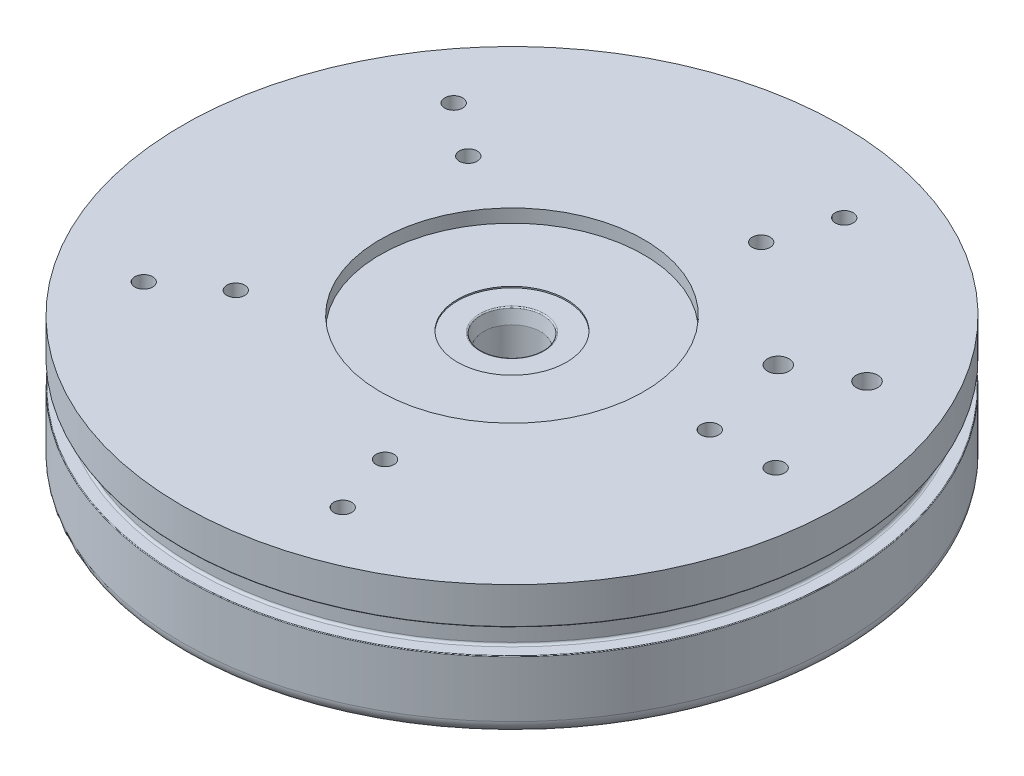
ISO-10303-21;
HEADER;
FILE_DESCRIPTION(('STEP AP214'),'2;1');
FILE_NAME('part.step','',(''),(''),'','','');
FILE_SCHEMA(('AUTOMOTIVE_DESIGN { 1 0 10303 214 1 1 1 1 }'));
ENDSEC;
DATA;
#1=APPLICATION_CONTEXT('core data for automotive mechanical design processes');
#2=APPLICATION_PROTOCOL_DEFINITION('international standard','automotive_design',2000,#1);
#3=PRODUCT_CONTEXT('',#1,'mechanical');
#4=PRODUCT('Part','Part','',(#3));
#5=PRODUCT_RELATED_PRODUCT_CATEGORY('part','',(#4));
#6=PRODUCT_DEFINITION_FORMATION('','',#4);
#7=PRODUCT_DEFINITION_CONTEXT('part definition',#1,'design');
#8=PRODUCT_DEFINITION('design','',#6,#7);
#9=PRODUCT_DEFINITION_SHAPE('','',#8);
#10=(LENGTH_UNIT() NAMED_UNIT(*) SI_UNIT(.MILLI.,.METRE.));
#11=(NAMED_UNIT(*) PLANE_ANGLE_UNIT() SI_UNIT($,.RADIAN.));
#12=(NAMED_UNIT(*) SI_UNIT($,.STERADIAN.) SOLID_ANGLE_UNIT());
#13=UNCERTAINTY_MEASURE_WITH_UNIT(LENGTH_MEASURE(1.E-05),#10,'distance_accuracy_value','');
#14=(GEOMETRIC_REPRESENTATION_CONTEXT(3) GLOBAL_UNCERTAINTY_ASSIGNED_CONTEXT((#13)) GLOBAL_UNIT_ASSIGNED_CONTEXT((#10,
#11,#12)) REPRESENTATION_CONTEXT('',''));
#15=CARTESIAN_POINT('',(0.,0.,0.));
#16=DIRECTION('',(0.,0.,1.));
#17=DIRECTION('',(1.,0.,0.));
#18=AXIS2_PLACEMENT_3D('',#15,#16,#17);
#19=CARTESIAN_POINT('',(0.,-12.065,0.));
#20=DIRECTION('',(0.,-1.,0.));
#21=DIRECTION('',(0.,0.,-1.));
#22=AXIS2_PLACEMENT_3D('',#19,#20,#21);
#23=TOROIDAL_SURFACE('',#22,63.373,0.127);
#24=CARTESIAN_POINT('',(0.,-12.065,0.));
#25=DIRECTION('',(0.,-1.,0.));
#26=DIRECTION('',(0.,0.,-1.));
#27=AXIS2_PLACEMENT_3D('',#24,#25,#26);
#28=CIRCLE('',#27,63.5);
#29=CARTESIAN_POINT('',(0.,-12.065,-63.5));
#30=VERTEX_POINT('',#29);
#31=EDGE_CURVE('E233',#30,#30,#28,.T.);
#32=ORIENTED_EDGE('',*,*,#31,.F.);
#33=EDGE_LOOP('',(#32));
#34=FACE_BOUND('',#33,.T.);
#35=CARTESIAN_POINT('',(0.,-11.938,0.));
#36=DIRECTION('',(0.,-1.,0.));
#37=DIRECTION('',(0.,0.,-1.));
#38=AXIS2_PLACEMENT_3D('',#35,#36,#37);
#39=CIRCLE('',#38,63.373);
#40=CARTESIAN_POINT('',(0.,-11.938,-63.373));
#41=VERTEX_POINT('',#40);
#42=EDGE_CURVE('E203',#41,#41,#39,.T.);
#43=ORIENTED_EDGE('',*,*,#42,.T.);
#44=EDGE_LOOP('',(#43));
#45=FACE_BOUND('',#44,.T.);
#46=ADVANCED_FACE('F47',(#34,#45),#23,.T.);
#47=CARTESIAN_POINT('',(0.,-12.7,0.));
#48=DIRECTION('',(0.,-1.,0.));
#49=DIRECTION('',(0.,0.,-1.));
#50=AXIS2_PLACEMENT_3D('',#47,#48,#49);
#51=CYLINDRICAL_SURFACE('',#50,63.5);
#52=CARTESIAN_POINT('',(0.,-22.86,0.));
#53=DIRECTION('',(0.,1.,0.));
#54=DIRECTION('',(0.,0.,1.));
#55=AXIS2_PLACEMENT_3D('',#52,#53,#54);
#56=CIRCLE('',#55,63.5);
#57=CARTESIAN_POINT('',(0.,-22.86,63.5));
#58=VERTEX_POINT('',#57);
#59=EDGE_CURVE('E13',#58,#58,#56,.T.);
#60=ORIENTED_EDGE('',*,*,#59,.T.);
#61=EDGE_LOOP('',(#60));
#62=FACE_BOUND('',#61,.T.);
#63=ORIENTED_EDGE('',*,*,#31,.T.);
#64=EDGE_LOOP('',(#63));
#65=FACE_BOUND('',#64,.T.);
#66=ADVANCED_FACE('F258',(#62,#65),#51,.T.);
#67=CARTESIAN_POINT('',(-63.5,-25.4,0.));
#68=DIRECTION('',(0.,1.,0.));
#69=DIRECTION('',(0.,0.,1.));
#70=AXIS2_PLACEMENT_3D('',#67,#68,#69);
#71=PLANE('',#70);
#72=CARTESIAN_POINT('',(0.,-25.4,0.));
#73=DIRECTION('',(0.,1.,0.));
#74=DIRECTION('',(0.,0.,1.));
#75=AXIS2_PLACEMENT_3D('',#72,#73,#74);
#76=CIRCLE('',#75,60.96);
#77=CARTESIAN_POINT('',(0.,-25.4,60.96));
#78=VERTEX_POINT('',#77);
#79=EDGE_CURVE('E56',#78,#78,#76,.F.);
#80=ORIENTED_EDGE('',*,*,#79,.T.);
#81=EDGE_LOOP('',(#80));
#82=FACE_BOUND('',#81,.T.);
#83=CARTESIAN_POINT('',(0.,-25.4,0.));
#84=DIRECTION('',(0.,-1.,0.));
#85=DIRECTION('',(0.,0.,-1.));
#86=AXIS2_PLACEMENT_3D('',#83,#84,#85);
#87=CIRCLE('',#86,50.8);
#88=CARTESIAN_POINT('',(0.,-25.4,-50.8));
#89=VERTEX_POINT('',#88);
#90=EDGE_CURVE('E230',#89,#89,#87,.T.);
#91=ORIENTED_EDGE('',*,*,#90,.F.);
#92=EDGE_LOOP('',(#91));
#93=FACE_BOUND('',#92,.T.);
#94=ADVANCED_FACE('F239',(#82,#93),#71,.F.);
#95=CARTESIAN_POINT('',(0.,-25.4,0.));
#96=DIRECTION('',(0.,-1.,0.));
#97=DIRECTION('',(0.,0.,-1.));
#98=AXIS2_PLACEMENT_3D('',#95,#96,#97);
#99=CONICAL_SURFACE('',#98,50.8,1.32581766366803);
#100=CARTESIAN_POINT('',(0.,-14.0890625,0.));
#101=DIRECTION('',(0.,-1.,0.));
#102=DIRECTION('',(0.,0.,-1.));
#103=AXIS2_PLACEMENT_3D('',#100,#101,#102);
#104=CIRCLE('',#103,5.55625);
#105=CARTESIAN_POINT('',(0.,-14.0890625,-5.55624999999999));
#106=VERTEX_POINT('',#105);
#107=EDGE_CURVE('E51',#106,#106,#104,.F.);
#108=CARTESIAN_POINT('',(0.,-14.0890625,-5.55624999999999));
#109=CARTESIAN_POINT('',(0.,-14.206884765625,-6.02753906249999));
#110=CARTESIAN_POINT('',(0.,-14.32470703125,-6.49882812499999));
#111=CARTESIAN_POINT('',(0.,-14.5603515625,-7.44140624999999));
#112=CARTESIAN_POINT('',(0.,-14.678173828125,-7.91269531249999));
#113=CARTESIAN_POINT('',(0.,-14.913818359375,-8.85527343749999));
#114=CARTESIAN_POINT('',(0.,-15.031640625,-9.32656249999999));
#115=CARTESIAN_POINT('',(0.,-15.26728515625,-10.269140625));
#116=CARTESIAN_POINT('',(0.,-15.385107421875,-10.7404296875));
#117=CARTESIAN_POINT('',(0.,-15.620751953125,-11.6830078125));
#118=CARTESIAN_POINT('',(0.,-15.73857421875,-12.154296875));
#119=CARTESIAN_POINT('',(0.,-15.97421875,-13.096875));
#120=CARTESIAN_POINT('',(0.,-16.092041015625,-13.5681640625));
#121=CARTESIAN_POINT('',(0.,-16.327685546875,-14.5107421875));
#122=CARTESIAN_POINT('',(0.,-16.4455078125,-14.98203125));
#123=CARTESIAN_POINT('',(0.,-16.68115234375,-15.924609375));
#124=CARTESIAN_POINT('',(0.,-16.798974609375,-16.3958984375));
#125=CARTESIAN_POINT('',(0.,-17.034619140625,-17.3384765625));
#126=CARTESIAN_POINT('',(0.,-17.15244140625,-17.809765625));
#127=CARTESIAN_POINT('',(0.,-17.3880859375,-18.75234375));
#128=CARTESIAN_POINT('',(0.,-17.505908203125,-19.2236328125));
#129=CARTESIAN_POINT('',(0.,-17.741552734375,-20.1662109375));
#130=CARTESIAN_POINT('',(0.,-17.859375,-20.6375));
#131=CARTESIAN_POINT('',(0.,-18.09501953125,-21.580078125));
#132=CARTESIAN_POINT('',(0.,-18.212841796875,-22.0513671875));
#133=CARTESIAN_POINT('',(0.,-18.448486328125,-22.9939453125));
#134=CARTESIAN_POINT('',(0.,-18.56630859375,-23.465234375));
#135=CARTESIAN_POINT('',(0.,-18.801953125,-24.4078125));
#136=CARTESIAN_POINT('',(0.,-18.919775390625,-24.8791015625));
#137=CARTESIAN_POINT('',(0.,-19.155419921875,-25.8216796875));
#138=CARTESIAN_POINT('',(0.,-19.2732421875,-26.29296875));
#139=CARTESIAN_POINT('',(0.,-19.50888671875,-27.235546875));
#140=CARTESIAN_POINT('',(0.,-19.626708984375,-27.7068359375));
#141=CARTESIAN_POINT('',(0.,-19.862353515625,-28.6494140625));
#142=CARTESIAN_POINT('',(0.,-19.98017578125,-29.120703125));
#143=CARTESIAN_POINT('',(0.,-20.2158203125,-30.06328125));
#144=CARTESIAN_POINT('',(0.,-20.333642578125,-30.5345703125));
#145=CARTESIAN_POINT('',(0.,-20.569287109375,-31.4771484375));
#146=CARTESIAN_POINT('',(0.,-20.687109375,-31.9484375));
#147=CARTESIAN_POINT('',(0.,-20.92275390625,-32.891015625));
#148=CARTESIAN_POINT('',(0.,-21.040576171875,-33.3623046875));
#149=CARTESIAN_POINT('',(0.,-21.276220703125,-34.3048828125));
#150=CARTESIAN_POINT('',(0.,-21.39404296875,-34.776171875));
#151=CARTESIAN_POINT('',(0.,-21.6296875,-35.71875));
#152=CARTESIAN_POINT('',(0.,-21.747509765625,-36.1900390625));
#153=CARTESIAN_POINT('',(0.,-21.983154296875,-37.1326171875));
#154=CARTESIAN_POINT('',(0.,-22.1009765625,-37.60390625));
#155=CARTESIAN_POINT('',(0.,-22.33662109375,-38.546484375));
#156=CARTESIAN_POINT('',(0.,-22.454443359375,-39.0177734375));
#157=CARTESIAN_POINT('',(0.,-22.690087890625,-39.9603515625));
#158=CARTESIAN_POINT('',(0.,-22.80791015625,-40.431640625));
#159=CARTESIAN_POINT('',(0.,-23.0435546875,-41.37421875));
#160=CARTESIAN_POINT('',(0.,-23.161376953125,-41.8455078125));
#161=CARTESIAN_POINT('',(0.,-23.397021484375,-42.7880859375));
#162=CARTESIAN_POINT('',(0.,-23.51484375,-43.259375));
#163=CARTESIAN_POINT('',(0.,-23.75048828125,-44.201953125));
#164=CARTESIAN_POINT('',(0.,-23.868310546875,-44.6732421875));
#165=CARTESIAN_POINT('',(0.,-24.103955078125,-45.6158203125));
#166=CARTESIAN_POINT('',(0.,-24.22177734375,-46.087109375));
#167=CARTESIAN_POINT('',(0.,-24.457421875,-47.0296875));
#168=CARTESIAN_POINT('',(0.,-24.575244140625,-47.5009765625));
#169=CARTESIAN_POINT('',(0.,-24.810888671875,-48.4435546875));
#170=CARTESIAN_POINT('',(0.,-24.9287109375,-48.91484375));
#171=CARTESIAN_POINT('',(0.,-25.16435546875,-49.857421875));
#172=CARTESIAN_POINT('',(0.,-25.282177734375,-50.3287109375));
#173=CARTESIAN_POINT('',(0.,-25.4,-50.8));
#174=B_SPLINE_CURVE_WITH_KNOTS('',3,(#108,#109,#110,#111,#112,#113,#114,#115,#116,#117,#118,
#119,#120,#121,#122,#123,#124,#125,#126,#127,#128,#129,#130,#131,#132,#133,#134,#135,#136,#137,
#138,#139,#140,#141,#142,#143,#144,#145,#146,#147,#148,#149,#150,#151,#152,#153,#154,#155,#156,
#157,#158,#159,#160,#161,#162,#163,#164,#165,#166,#167,#168,#169,#170,#171,#172,#173),
.UNSPECIFIED.,.F.,.F.,(4,2,2,2,2,2,2,2,2,2,2,2,2,2,2,2,2,2,2,2,2,2,2,2,2,2,2,2,2,2,2,2,4),(0.,
1.45738093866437,2.91476187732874,4.3721428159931,5.82952375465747,7.28690469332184,
8.74428563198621,10.2016665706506,11.6590475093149,13.1164284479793,14.5738093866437,
16.031190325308,17.4885712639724,18.9459522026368,20.4033331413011,21.8607140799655,
23.3180950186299,24.7754759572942,26.2328568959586,27.690237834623,29.1476187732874,
30.6049997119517,32.0623806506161,33.5197615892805,34.9771425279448,36.4345234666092,
37.8919044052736,39.3492853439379,40.8066662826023,42.2640472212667,43.721428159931,
45.1788090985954,46.6361900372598),.UNSPECIFIED.);
#175=EDGE_CURVE('BSEAM270',#106,#89,#174,.T.);
#176=ORIENTED_EDGE('',*,*,#107,.T.);
#177=ORIENTED_EDGE('',*,*,#90,.T.);
#178=ORIENTED_EDGE('',*,*,#175,.T.);
#179=ORIENTED_EDGE('',*,*,#175,.F.);
#180=EDGE_LOOP('',(#176,#178,#177,#179));
#181=FACE_BOUND('',#180,.T.);
#182=ADVANCED_FACE('F270',(#181),#99,.F.);
#183=CARTESIAN_POINT('',(-63.5,0.,0.));
#184=DIRECTION('',(0.,-1.,0.));
#185=DIRECTION('',(0.,0.,-1.));
#186=AXIS2_PLACEMENT_3D('',#183,#184,#185);
#187=PLANE('',#186);
#188=CARTESIAN_POINT('',(45.1843543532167,0.,-23.216677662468));
#189=DIRECTION('',(0.,1.,0.));
#190=DIRECTION('',(0.,0.,1.));
#191=AXIS2_PLACEMENT_3D('',#188,#189,#190);
#192=CIRCLE('',#191,2.0828);
#193=CARTESIAN_POINT('',(45.1843543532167,0.,-21.133877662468));
#194=VERTEX_POINT('',#193);
#195=EDGE_CURVE('E437',#194,#194,#192,.T.);
#196=ORIENTED_EDGE('',*,*,#195,.F.);
#197=EDGE_LOOP('',(#196));
#198=FACE_BOUND('',#197,.T.);
#199=CARTESIAN_POINT('',(33.8882657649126,0.,-17.412508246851));
#200=DIRECTION('',(0.,1.,0.));
#201=DIRECTION('',(0.,0.,1.));
#202=AXIS2_PLACEMENT_3D('',#199,#200,#201);
#203=CIRCLE('',#202,2.0828);
#204=CARTESIAN_POINT('',(33.8882657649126,0.,-15.329708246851));
#205=VERTEX_POINT('',#204);
#206=EDGE_CURVE('E103',#205,#205,#203,.T.);
#207=ORIENTED_EDGE('',*,*,#206,.F.);
#208=EDGE_LOOP('',(#207));
#209=FACE_BOUND('',#208,.T.);
#210=CARTESIAN_POINT('',(11.7735474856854,0.,-36.2352532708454));
#211=DIRECTION('',(0.,1.,0.));
#212=DIRECTION('',(0.,0.,1.));
#213=AXIS2_PLACEMENT_3D('',#210,#211,#212);
#214=CIRCLE('',#213,1.72719999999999);
#215=CARTESIAN_POINT('',(11.7735474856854,0.,-34.5080532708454));
#216=VERTEX_POINT('',#215);
#217=EDGE_CURVE('E122',#216,#216,#214,.T.);
#218=ORIENTED_EDGE('',*,*,#217,.F.);
#219=EDGE_LOOP('',(#218));
#220=FACE_BOUND('',#219,.T.);
#221=CARTESIAN_POINT('',(15.6980633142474,0.,-48.3136710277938));
#222=DIRECTION('',(0.,1.,0.));
#223=DIRECTION('',(0.,0.,1.));
#224=AXIS2_PLACEMENT_3D('',#221,#222,#223);
#225=CIRCLE('',#224,1.72719999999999);
#226=CARTESIAN_POINT('',(15.6980633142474,0.,-46.5864710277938));
#227=VERTEX_POINT('',#226);
#228=EDGE_CURVE('E128',#227,#227,#225,.T.);
#229=ORIENTED_EDGE('',*,*,#228,.F.);
#230=EDGE_LOOP('',(#229));
#231=FACE_BOUND('',#230,.T.);
#232=CARTESIAN_POINT('',(-30.8235474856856,0.,-22.3946181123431));
#233=DIRECTION('',(0.,1.,0.));
#234=DIRECTION('',(0.,0.,1.));
#235=AXIS2_PLACEMENT_3D('',#232,#233,#234);
#236=CIRCLE('',#235,1.72719999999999);
#237=CARTESIAN_POINT('',(-30.8235474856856,0.,-20.6674181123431));
#238=VERTEX_POINT('',#237);
#239=EDGE_CURVE('E134',#238,#238,#236,.T.);
#240=ORIENTED_EDGE('',*,*,#239,.F.);
#241=EDGE_LOOP('',(#240));
#242=FACE_BOUND('',#241,.T.);
#243=CARTESIAN_POINT('',(-41.0980633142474,0.,-29.8594908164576));
#244=DIRECTION('',(0.,1.,0.));
#245=DIRECTION('',(0.,0.,1.));
#246=AXIS2_PLACEMENT_3D('',#243,#244,#245);
#247=CIRCLE('',#246,1.72719999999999);
#248=CARTESIAN_POINT('',(-41.0980633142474,0.,-28.1322908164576));
#249=VERTEX_POINT('',#248);
#250=EDGE_CURVE('E140',#249,#249,#247,.T.);
#251=ORIENTED_EDGE('',*,*,#250,.F.);
#252=EDGE_LOOP('',(#251));
#253=FACE_BOUND('',#252,.T.);
#254=CARTESIAN_POINT('',(-30.8235474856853,0.,22.3946181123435));
#255=DIRECTION('',(0.,1.,0.));
#256=DIRECTION('',(0.,0.,1.));
#257=AXIS2_PLACEMENT_3D('',#254,#255,#256);
#258=CIRCLE('',#257,1.72719999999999);
#259=CARTESIAN_POINT('',(-30.8235474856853,0.,24.1218181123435));
#260=VERTEX_POINT('',#259);
#261=EDGE_CURVE('E146',#260,#260,#258,.T.);
#262=ORIENTED_EDGE('',*,*,#261,.F.);
#263=EDGE_LOOP('',(#262));
#264=FACE_BOUND('',#263,.T.);
#265=CARTESIAN_POINT('',(-41.0980633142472,0.,29.8594908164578));
#266=DIRECTION('',(0.,1.,0.));
#267=DIRECTION('',(0.,0.,1.));
#268=AXIS2_PLACEMENT_3D('',#265,#266,#267);
#269=CIRCLE('',#268,1.72719999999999);
#270=CARTESIAN_POINT('',(-41.0980633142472,0.,31.5866908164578));
#271=VERTEX_POINT('',#270);
#272=EDGE_CURVE('E152',#271,#271,#269,.T.);
#273=ORIENTED_EDGE('',*,*,#272,.F.);
#274=EDGE_LOOP('',(#273));
#275=FACE_BOUND('',#274,.T.);
#276=CARTESIAN_POINT('',(11.7735474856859,0.,36.2352532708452));
#277=DIRECTION('',(0.,1.,0.));
#278=DIRECTION('',(0.,0.,1.));
#279=AXIS2_PLACEMENT_3D('',#276,#277,#278);
#280=CIRCLE('',#279,1.72719999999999);
#281=CARTESIAN_POINT('',(11.7735474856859,0.,37.9624532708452));
#282=VERTEX_POINT('',#281);
#283=EDGE_CURVE('E158',#282,#282,#280,.T.);
#284=ORIENTED_EDGE('',*,*,#283,.F.);
#285=EDGE_LOOP('',(#284));
#286=FACE_BOUND('',#285,.T.);
#287=CARTESIAN_POINT('',(15.6980633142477,0.,48.3136710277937));
#288=DIRECTION('',(0.,1.,0.));
#289=DIRECTION('',(0.,0.,1.));
#290=AXIS2_PLACEMENT_3D('',#287,#288,#289);
#291=CIRCLE('',#290,1.72719999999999);
#292=CARTESIAN_POINT('',(15.6980633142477,0.,50.0408710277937));
#293=VERTEX_POINT('',#292);
#294=EDGE_CURVE('E164',#293,#293,#291,.T.);
#295=ORIENTED_EDGE('',*,*,#294,.F.);
#296=EDGE_LOOP('',(#295));
#297=FACE_BOUND('',#296,.T.);
#298=CARTESIAN_POINT('',(38.1,0.,-5.25712708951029E-13));
#299=DIRECTION('',(0.,1.,0.));
#300=DIRECTION('',(0.,0.,1.));
#301=AXIS2_PLACEMENT_3D('',#298,#299,#300);
#302=CIRCLE('',#301,1.72719999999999);
#303=CARTESIAN_POINT('',(38.1,0.,1.72719999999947));
#304=VERTEX_POINT('',#303);
#305=EDGE_CURVE('E170',#304,#304,#302,.T.);
#306=ORIENTED_EDGE('',*,*,#305,.F.);
#307=EDGE_LOOP('',(#306));
#308=FACE_BOUND('',#307,.T.);
#309=CARTESIAN_POINT('',(50.8,0.,-5.25007717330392E-13));
#310=DIRECTION('',(0.,1.,0.));
#311=DIRECTION('',(0.,0.,1.));
#312=AXIS2_PLACEMENT_3D('',#309,#310,#311);
#313=CIRCLE('',#312,1.72719999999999);
#314=CARTESIAN_POINT('',(50.8,0.,1.72719999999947));
#315=VERTEX_POINT('',#314);
#316=EDGE_CURVE('E176',#315,#315,#313,.T.);
#317=ORIENTED_EDGE('',*,*,#316,.F.);
#318=EDGE_LOOP('',(#317));
#319=FACE_BOUND('',#318,.T.);
#320=CARTESIAN_POINT('',(0.,0.,0.));
#321=DIRECTION('',(0.,1.,0.));
#322=DIRECTION('',(0.,0.,1.));
#323=AXIS2_PLACEMENT_3D('',#320,#321,#322);
#324=CIRCLE('',#323,25.4);
#325=CARTESIAN_POINT('',(0.,0.,25.4));
#326=VERTEX_POINT('',#325);
#327=EDGE_CURVE('E204',#326,#326,#324,.T.);
#328=ORIENTED_EDGE('',*,*,#327,.F.);
#329=EDGE_LOOP('',(#328));
#330=FACE_BOUND('',#329,.T.);
#331=CARTESIAN_POINT('',(0.,0.,0.));
#332=DIRECTION('',(0.,-1.,0.));
#333=DIRECTION('',(0.,0.,-1.));
#334=AXIS2_PLACEMENT_3D('',#331,#332,#333);
#335=CIRCLE('',#334,63.5);
#336=CARTESIAN_POINT('',(0.,0.,-63.5));
#337=VERTEX_POINT('',#336);
#338=EDGE_CURVE('E227',#337,#337,#335,.T.);
#339=ORIENTED_EDGE('',*,*,#338,.F.);
#340=EDGE_LOOP('',(#339));
#341=FACE_BOUND('',#340,.T.);
#342=ADVANCED_FACE('F273',(#198,#209,#220,#231,#242,#253,#264,#275,#286,#297,#308,#319,#330,
#341),#187,.F.);
#343=CARTESIAN_POINT('',(0.,-12.7,0.));
#344=DIRECTION('',(0.,-1.,0.));
#345=DIRECTION('',(0.,0.,-1.));
#346=AXIS2_PLACEMENT_3D('',#343,#344,#345);
#347=CYLINDRICAL_SURFACE('',#346,63.5);
#348=CARTESIAN_POINT('',(0.,-6.985,0.));
#349=DIRECTION('',(0.,-1.,0.));
#350=DIRECTION('',(0.,0.,-1.));
#351=AXIS2_PLACEMENT_3D('',#348,#349,#350);
#352=CIRCLE('',#351,63.5);
#353=CARTESIAN_POINT('',(0.,-6.985,-63.5));
#354=VERTEX_POINT('',#353);
#355=EDGE_CURVE('E224',#354,#354,#352,.T.);
#356=ORIENTED_EDGE('',*,*,#355,.F.);
#357=EDGE_LOOP('',(#356));
#358=FACE_BOUND('',#357,.T.);
#359=ORIENTED_EDGE('',*,*,#338,.T.);
#360=EDGE_LOOP('',(#359));
#361=FACE_BOUND('',#360,.T.);
#362=ADVANCED_FACE('F277',(#358,#361),#347,.T.);
#363=CARTESIAN_POINT('',(0.,-6.985,0.));
#364=DIRECTION('',(0.,-1.,0.));
#365=DIRECTION('',(0.,0.,-1.));
#366=AXIS2_PLACEMENT_3D('',#363,#364,#365);
#367=TOROIDAL_SURFACE('',#366,63.373,0.127);
#368=CARTESIAN_POINT('',(0.,-7.112,0.));
#369=DIRECTION('',(0.,-1.,0.));
#370=DIRECTION('',(0.,0.,-1.));
#371=AXIS2_PLACEMENT_3D('',#368,#369,#370);
#372=CIRCLE('',#371,63.373);
#373=CARTESIAN_POINT('',(0.,-7.112,-63.373));
#374=VERTEX_POINT('',#373);
#375=EDGE_CURVE('E221',#374,#374,#372,.T.);
#376=ORIENTED_EDGE('',*,*,#375,.F.);
#377=EDGE_LOOP('',(#376));
#378=FACE_BOUND('',#377,.T.);
#379=ORIENTED_EDGE('',*,*,#355,.T.);
#380=EDGE_LOOP('',(#379));
#381=FACE_BOUND('',#380,.T.);
#382=ADVANCED_FACE('F281',(#378,#381),#367,.T.);
#383=CARTESIAN_POINT('',(-61.3029,-7.112,0.));
#384=DIRECTION('',(0.,1.,0.));
#385=DIRECTION('',(0.,0.,1.));
#386=AXIS2_PLACEMENT_3D('',#383,#384,#385);
#387=PLANE('',#386);
#388=CARTESIAN_POINT('',(0.,-7.112,0.));
#389=DIRECTION('',(0.,-1.,0.));
#390=DIRECTION('',(0.,0.,-1.));
#391=AXIS2_PLACEMENT_3D('',#388,#389,#390);
#392=CIRCLE('',#391,61.3029);
#393=CARTESIAN_POINT('',(0.,-7.112,-61.3029));
#394=VERTEX_POINT('',#393);
#395=EDGE_CURVE('E218',#394,#394,#392,.T.);
#396=ORIENTED_EDGE('',*,*,#395,.F.);
#397=EDGE_LOOP('',(#396));
#398=FACE_BOUND('',#397,.T.);
#399=ORIENTED_EDGE('',*,*,#375,.T.);
#400=EDGE_LOOP('',(#399));
#401=FACE_BOUND('',#400,.T.);
#402=ADVANCED_FACE('F285',(#398,#401),#387,.F.);
#403=CARTESIAN_POINT('',(0.,-7.5565,0.));
#404=DIRECTION('',(0.,-1.,0.));
#405=DIRECTION('',(0.,0.,-1.));
#406=AXIS2_PLACEMENT_3D('',#403,#404,#405);
#407=TOROIDAL_SURFACE('',#406,61.3029,0.444500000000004);
#408=CARTESIAN_POINT('',(0.,-7.5565,0.));
#409=DIRECTION('',(0.,-1.,0.));
#410=DIRECTION('',(0.,0.,-1.));
#411=AXIS2_PLACEMENT_3D('',#408,#409,#410);
#412=CIRCLE('',#411,60.8584);
#413=CARTESIAN_POINT('',(0.,-7.5565,-60.8584));
#414=VERTEX_POINT('',#413);
#415=EDGE_CURVE('E215',#414,#414,#412,.T.);
#416=ORIENTED_EDGE('',*,*,#415,.F.);
#417=EDGE_LOOP('',(#416));
#418=FACE_BOUND('',#417,.T.);
#419=ORIENTED_EDGE('',*,*,#395,.T.);
#420=EDGE_LOOP('',(#419));
#421=FACE_BOUND('',#420,.T.);
#422=ADVANCED_FACE('F289',(#418,#421),#407,.F.);
#423=CARTESIAN_POINT('',(0.,-12.7,0.));
#424=DIRECTION('',(0.,-1.,0.));
#425=DIRECTION('',(0.,0.,-1.));
#426=AXIS2_PLACEMENT_3D('',#423,#424,#425);
#427=CYLINDRICAL_SURFACE('',#426,60.8584);
#428=CARTESIAN_POINT('',(0.,-11.4935,0.));
#429=DIRECTION('',(0.,-1.,0.));
#430=DIRECTION('',(0.,0.,-1.));
#431=AXIS2_PLACEMENT_3D('',#428,#429,#430);
#432=CIRCLE('',#431,60.8584);
#433=CARTESIAN_POINT('',(0.,-11.4935,-60.8584));
#434=VERTEX_POINT('',#433);
#435=EDGE_CURVE('E212',#434,#434,#432,.T.);
#436=ORIENTED_EDGE('',*,*,#435,.F.);
#437=EDGE_LOOP('',(#436));
#438=FACE_BOUND('',#437,.T.);
#439=ORIENTED_EDGE('',*,*,#415,.T.);
#440=EDGE_LOOP('',(#439));
#441=FACE_BOUND('',#440,.T.);
#442=ADVANCED_FACE('F293',(#438,#441),#427,.T.);
#443=CARTESIAN_POINT('',(0.,-11.4935,0.));
#444=DIRECTION('',(0.,-1.,0.));
#445=DIRECTION('',(0.,0.,-1.));
#446=AXIS2_PLACEMENT_3D('',#443,#444,#445);
#447=TOROIDAL_SURFACE('',#446,61.3029,0.444500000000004);
#448=CARTESIAN_POINT('',(0.,-11.938,0.));
#449=DIRECTION('',(0.,-1.,0.));
#450=DIRECTION('',(0.,0.,-1.));
#451=AXIS2_PLACEMENT_3D('',#448,#449,#450);
#452=CIRCLE('',#451,61.3029);
#453=CARTESIAN_POINT('',(0.,-11.938,-61.3029));
#454=VERTEX_POINT('',#453);
#455=EDGE_CURVE('E209',#454,#454,#452,.T.);
#456=ORIENTED_EDGE('',*,*,#455,.F.);
#457=EDGE_LOOP('',(#456));
#458=FACE_BOUND('',#457,.T.);
#459=ORIENTED_EDGE('',*,*,#435,.T.);
#460=EDGE_LOOP('',(#459));
#461=FACE_BOUND('',#460,.T.);
#462=ADVANCED_FACE('F253',(#458,#461),#447,.F.);
#463=CARTESIAN_POINT('',(-61.3029,-11.938,0.));
#464=DIRECTION('',(0.,-1.,0.));
#465=DIRECTION('',(0.,0.,-1.));
#466=AXIS2_PLACEMENT_3D('',#463,#464,#465);
#467=PLANE('',#466);
#468=ORIENTED_EDGE('',*,*,#42,.F.);
#469=EDGE_LOOP('',(#468));
#470=FACE_BOUND('',#469,.T.);
#471=ORIENTED_EDGE('',*,*,#455,.T.);
#472=EDGE_LOOP('',(#471));
#473=FACE_BOUND('',#472,.T.);
#474=ADVANCED_FACE('F244',(#470,#473),#467,.F.);
#475=CARTESIAN_POINT('',(0.,-22.86,0.));
#476=DIRECTION('',(0.,1.,0.));
#477=DIRECTION('',(0.,0.,1.));
#478=AXIS2_PLACEMENT_3D('',#475,#476,#477);
#479=TOROIDAL_SURFACE('',#478,60.96,2.54);
#480=ORIENTED_EDGE('',*,*,#59,.F.);
#481=EDGE_LOOP('',(#480));
#482=FACE_BOUND('',#481,.T.);
#483=ORIENTED_EDGE('',*,*,#79,.F.);
#484=EDGE_LOOP('',(#483));
#485=FACE_BOUND('',#484,.T.);
#486=ADVANCED_FACE('F49',(#482,#485),#479,.T.);
#487=CARTESIAN_POINT('',(0.,-2.54,0.));
#488=DIRECTION('',(0.,1.,0.));
#489=DIRECTION('',(0.,0.,1.));
#490=AXIS2_PLACEMENT_3D('',#487,#488,#489);
#491=CYLINDRICAL_SURFACE('',#490,25.4);
#492=CARTESIAN_POINT('',(0.,-2.54,0.));
#493=DIRECTION('',(0.,1.,0.));
#494=DIRECTION('',(0.,0.,1.));
#495=AXIS2_PLACEMENT_3D('',#492,#493,#494);
#496=CIRCLE('',#495,25.4);
#497=CARTESIAN_POINT('',(0.,-2.54,25.4));
#498=VERTEX_POINT('',#497);
#499=EDGE_CURVE('E200',#498,#498,#496,.T.);
#500=ORIENTED_EDGE('',*,*,#499,.F.);
#501=EDGE_LOOP('',(#500));
#502=FACE_BOUND('',#501,.T.);
#503=ORIENTED_EDGE('',*,*,#327,.T.);
#504=EDGE_LOOP('',(#503));
#505=FACE_BOUND('',#504,.T.);
#506=ADVANCED_FACE('F243',(#502,#505),#491,.F.);
#507=CARTESIAN_POINT('',(0.,-2.54,0.));
#508=DIRECTION('',(0.,1.,0.));
#509=DIRECTION('',(0.,0.,1.));
#510=AXIS2_PLACEMENT_3D('',#507,#508,#509);
#511=PLANE('',#510);
#512=CARTESIAN_POINT('',(0.,-2.54000000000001,0.));
#513=DIRECTION('',(0.,1.,0.));
#514=DIRECTION('',(0.,0.,1.));
#515=AXIS2_PLACEMENT_3D('',#512,#513,#514);
#516=CIRCLE('',#515,10.5);
#517=CARTESIAN_POINT('',(0.,-2.54000000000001,10.5));
#518=VERTEX_POINT('',#517);
#519=EDGE_CURVE('E197',#518,#518,#516,.T.);
#520=ORIENTED_EDGE('',*,*,#519,.F.);
#521=EDGE_LOOP('',(#520));
#522=FACE_BOUND('',#521,.T.);
#523=ORIENTED_EDGE('',*,*,#499,.T.);
#524=EDGE_LOOP('',(#523));
#525=FACE_BOUND('',#524,.T.);
#526=ADVANCED_FACE('F250',(#522,#525),#511,.T.);
#527=CARTESIAN_POINT('',(0.,-2.54,0.));
#528=DIRECTION('',(0.,1.,0.));
#529=DIRECTION('',(0.,0.,1.));
#530=AXIS2_PLACEMENT_3D('',#527,#528,#529);
#531=CYLINDRICAL_SURFACE('',#530,5.55625);
#532=CARTESIAN_POINT('',(0.,-5.30441779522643,0.));
#533=DIRECTION('',(0.,1.,0.));
#534=DIRECTION('',(0.,0.,1.));
#535=AXIS2_PLACEMENT_3D('',#532,#533,#534);
#536=CIRCLE('',#535,5.55625);
#537=CARTESIAN_POINT('',(0.,-5.30441779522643,5.55625));
#538=VERTEX_POINT('',#537);
#539=EDGE_CURVE('E182',#538,#538,#536,.T.);
#540=ORIENTED_EDGE('',*,*,#539,.T.);
#541=EDGE_LOOP('',(#540));
#542=FACE_BOUND('',#541,.T.);
#543=ORIENTED_EDGE('',*,*,#107,.F.);
#544=EDGE_LOOP('',(#543));
#545=FACE_BOUND('',#544,.T.);
#546=ADVANCED_FACE('F303',(#542,#545),#531,.F.);
#547=CARTESIAN_POINT('',(0.,-2.54,0.));
#548=DIRECTION('',(0.,1.,0.));
#549=DIRECTION('',(0.,0.,1.));
#550=AXIS2_PLACEMENT_3D('',#547,#548,#549);
#551=CYLINDRICAL_SURFACE('',#550,10.5);
#552=CARTESIAN_POINT('',(0.,-2.79400000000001,0.));
#553=DIRECTION('',(0.,1.,0.));
#554=DIRECTION('',(0.,0.,1.));
#555=AXIS2_PLACEMENT_3D('',#552,#553,#554);
#556=CIRCLE('',#555,10.5);
#557=CARTESIAN_POINT('',(0.,-2.79400000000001,10.5));
#558=VERTEX_POINT('',#557);
#559=EDGE_CURVE('E194',#558,#558,#556,.T.);
#560=ORIENTED_EDGE('',*,*,#559,.F.);
#561=EDGE_LOOP('',(#560));
#562=FACE_BOUND('',#561,.T.);
#563=ORIENTED_EDGE('',*,*,#519,.T.);
#564=EDGE_LOOP('',(#563));
#565=FACE_BOUND('',#564,.T.);
#566=ADVANCED_FACE('F305',(#562,#565),#551,.F.);
#567=CARTESIAN_POINT('',(-6.22499116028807,-2.79400000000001,-0.0104906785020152));
#568=DIRECTION('',(0.,-1.,0.));
#569=DIRECTION('',(0.,0.,-1.));
#570=AXIS2_PLACEMENT_3D('',#567,#568,#569);
#571=PLANE('',#570);
#572=CARTESIAN_POINT('',(0.,-2.79400000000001,0.));
#573=DIRECTION('',(0.,1.,0.));
#574=DIRECTION('',(0.,0.,1.));
#575=AXIS2_PLACEMENT_3D('',#572,#573,#574);
#576=CIRCLE('',#575,6.225);
#577=CARTESIAN_POINT('',(0.,-2.79400000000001,6.225));
#578=VERTEX_POINT('',#577);
#579=EDGE_CURVE('E191',#578,#578,#576,.T.);
#580=ORIENTED_EDGE('',*,*,#579,.F.);
#581=EDGE_LOOP('',(#580));
#582=FACE_BOUND('',#581,.T.);
#583=ORIENTED_EDGE('',*,*,#559,.T.);
#584=EDGE_LOOP('',(#583));
#585=FACE_BOUND('',#584,.T.);
#586=ADVANCED_FACE('F308',(#582,#585),#571,.F.);
#587=CARTESIAN_POINT('',(0.,-3.04800000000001,0.));
#588=DIRECTION('',(0.,1.,0.));
#589=DIRECTION('',(0.,0.,1.));
#590=AXIS2_PLACEMENT_3D('',#587,#588,#589);
#591=TOROIDAL_SURFACE('',#590,6.225,0.254);
#592=CARTESIAN_POINT('',(0.,-2.9951904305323,0.));
#593=DIRECTION('',(0.,1.,0.));
#594=DIRECTION('',(0.,0.,1.));
#595=AXIS2_PLACEMENT_3D('',#592,#593,#594);
#596=CIRCLE('',#595,5.97655050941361);
#597=CARTESIAN_POINT('',(0.,-2.9951904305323,5.97655050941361));
#598=VERTEX_POINT('',#597);
#599=EDGE_CURVE('E188',#598,#598,#596,.T.);
#600=ORIENTED_EDGE('',*,*,#599,.F.);
#601=EDGE_LOOP('',(#600));
#602=FACE_BOUND('',#601,.T.);
#603=ORIENTED_EDGE('',*,*,#579,.T.);
#604=EDGE_LOOP('',(#603));
#605=FACE_BOUND('',#604,.T.);
#606=ADVANCED_FACE('F312',(#602,#605),#591,.T.);
#607=CARTESIAN_POINT('',(0.,-2.9951904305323,0.));
#608=DIRECTION('',(0.,1.,0.));
#609=DIRECTION('',(0.,0.,1.));
#610=AXIS2_PLACEMENT_3D('',#607,#608,#609);
#611=CONICAL_SURFACE('',#610,5.97655050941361,0.209439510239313);
#612=CARTESIAN_POINT('',(0.,-5.39400000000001,0.));
#613=DIRECTION('',(0.,1.,0.));
#614=DIRECTION('',(0.,0.,1.));
#615=AXIS2_PLACEMENT_3D('',#612,#613,#614);
#616=CIRCLE('',#615,5.46666779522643);
#617=CARTESIAN_POINT('',(0.,-5.39400000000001,5.46666779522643));
#618=VERTEX_POINT('',#617);
#619=EDGE_CURVE('E185',#618,#618,#616,.T.);
#620=ORIENTED_EDGE('',*,*,#619,.F.);
#621=EDGE_LOOP('',(#620));
#622=FACE_BOUND('',#621,.T.);
#623=ORIENTED_EDGE('',*,*,#599,.T.);
#624=EDGE_LOOP('',(#623));
#625=FACE_BOUND('',#624,.T.);
#626=ADVANCED_FACE('F316',(#622,#625),#611,.F.);
#627=CARTESIAN_POINT('',(0.,-5.39400000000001,0.));
#628=DIRECTION('',(0.,1.,0.));
#629=DIRECTION('',(0.,0.,1.));
#630=AXIS2_PLACEMENT_3D('',#627,#628,#629);
#631=CONICAL_SURFACE('',#630,5.46666779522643,0.785398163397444);
#632=ORIENTED_EDGE('',*,*,#539,.F.);
#633=EDGE_LOOP('',(#632));
#634=FACE_BOUND('',#633,.T.);
#635=ORIENTED_EDGE('',*,*,#619,.T.);
#636=EDGE_LOOP('',(#635));
#637=FACE_BOUND('',#636,.T.);
#638=ADVANCED_FACE('F320',(#634,#637),#631,.T.);
#639=CARTESIAN_POINT('',(50.8,-8.7376,-5.25007717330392E-13));
#640=DIRECTION('',(0.,1.,0.));
#641=DIRECTION('',(0.,0.,1.));
#642=AXIS2_PLACEMENT_3D('',#639,#640,#641);
#643=CONICAL_SURFACE('',#642,1.7272,1.02974425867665);
#644=CARTESIAN_POINT('',(50.8,-9.7754064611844,-5.25007717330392E-13));
#645=VERTEX_POINT('',#644);
#646=VERTEX_LOOP('',#645);
#647=FACE_BOUND('',#646,.T.);
#648=CARTESIAN_POINT('',(50.8,-8.7376,-5.25007717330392E-13));
#649=DIRECTION('',(0.,1.,0.));
#650=DIRECTION('',(0.,0.,1.));
#651=AXIS2_PLACEMENT_3D('',#648,#649,#650);
#652=CIRCLE('',#651,1.7272);
#653=CARTESIAN_POINT('',(50.8,-8.7376,1.72719999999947));
#654=VERTEX_POINT('',#653);
#655=EDGE_CURVE('E179',#654,#654,#652,.T.);
#656=ORIENTED_EDGE('',*,*,#655,.T.);
#657=EDGE_LOOP('',(#656));
#658=FACE_BOUND('',#657,.T.);
#659=ADVANCED_FACE('F324',(#647,#658),#643,.F.);
#660=CARTESIAN_POINT('',(50.8,0.,-5.25007717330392E-13));
#661=DIRECTION('',(0.,1.,0.));
#662=DIRECTION('',(0.,0.,1.));
#663=AXIS2_PLACEMENT_3D('',#660,#661,#662);
#664=CYLINDRICAL_SURFACE('',#663,1.72719999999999);
#665=ORIENTED_EDGE('',*,*,#655,.F.);
#666=EDGE_LOOP('',(#665));
#667=FACE_BOUND('',#666,.T.);
#668=ORIENTED_EDGE('',*,*,#316,.T.);
#669=EDGE_LOOP('',(#668));
#670=FACE_BOUND('',#669,.T.);
#671=ADVANCED_FACE('F331',(#667,#670),#664,.F.);
#672=CARTESIAN_POINT('',(38.1,-8.7376,-5.25712708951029E-13));
#673=DIRECTION('',(0.,1.,0.));
#674=DIRECTION('',(0.,0.,1.));
#675=AXIS2_PLACEMENT_3D('',#672,#673,#674);
#676=CONICAL_SURFACE('',#675,1.7272,1.02974425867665);
#677=CARTESIAN_POINT('',(38.1,-9.7754064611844,-5.25712708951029E-13));
#678=VERTEX_POINT('',#677);
#679=VERTEX_LOOP('',#678);
#680=FACE_BOUND('',#679,.T.);
#681=CARTESIAN_POINT('',(38.1,-8.7376,-5.25712708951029E-13));
#682=DIRECTION('',(0.,1.,0.));
#683=DIRECTION('',(0.,0.,1.));
#684=AXIS2_PLACEMENT_3D('',#681,#682,#683);
#685=CIRCLE('',#684,1.7272);
#686=CARTESIAN_POINT('',(38.1,-8.7376,1.72719999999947));
#687=VERTEX_POINT('',#686);
#688=EDGE_CURVE('E173',#687,#687,#685,.T.);
#689=ORIENTED_EDGE('',*,*,#688,.T.);
#690=EDGE_LOOP('',(#689));
#691=FACE_BOUND('',#690,.T.);
#692=ADVANCED_FACE('F334',(#680,#691),#676,.F.);
#693=CARTESIAN_POINT('',(38.1,0.,-5.25712708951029E-13));
#694=DIRECTION('',(0.,1.,0.));
#695=DIRECTION('',(0.,0.,1.));
#696=AXIS2_PLACEMENT_3D('',#693,#694,#695);
#697=CYLINDRICAL_SURFACE('',#696,1.72719999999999);
#698=ORIENTED_EDGE('',*,*,#688,.F.);
#699=EDGE_LOOP('',(#698));
#700=FACE_BOUND('',#699,.T.);
#701=ORIENTED_EDGE('',*,*,#305,.T.);
#702=EDGE_LOOP('',(#701));
#703=FACE_BOUND('',#702,.T.);
#704=ADVANCED_FACE('F338',(#700,#703),#697,.F.);
#705=CARTESIAN_POINT('',(15.6980633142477,-8.7376,48.3136710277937));
#706=DIRECTION('',(0.,1.,0.));
#707=DIRECTION('',(0.,0.,1.));
#708=AXIS2_PLACEMENT_3D('',#705,#706,#707);
#709=CONICAL_SURFACE('',#708,1.7272,1.02974425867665);
#710=CARTESIAN_POINT('',(15.6980633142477,-9.7754064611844,48.3136710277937));
#711=VERTEX_POINT('',#710);
#712=VERTEX_LOOP('',#711);
#713=FACE_BOUND('',#712,.T.);
#714=CARTESIAN_POINT('',(15.6980633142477,-8.7376,48.3136710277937));
#715=DIRECTION('',(0.,1.,0.));
#716=DIRECTION('',(0.,0.,1.));
#717=AXIS2_PLACEMENT_3D('',#714,#715,#716);
#718=CIRCLE('',#717,1.7272);
#719=CARTESIAN_POINT('',(15.6980633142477,-8.7376,50.0408710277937));
#720=VERTEX_POINT('',#719);
#721=EDGE_CURVE('E167',#720,#720,#718,.T.);
#722=ORIENTED_EDGE('',*,*,#721,.T.);
#723=EDGE_LOOP('',(#722));
#724=FACE_BOUND('',#723,.T.);
#725=ADVANCED_FACE('F341',(#713,#724),#709,.F.);
#726=CARTESIAN_POINT('',(15.6980633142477,0.,48.3136710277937));
#727=DIRECTION('',(0.,1.,0.));
#728=DIRECTION('',(0.,0.,1.));
#729=AXIS2_PLACEMENT_3D('',#726,#727,#728);
#730=CYLINDRICAL_SURFACE('',#729,1.72719999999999);
#731=ORIENTED_EDGE('',*,*,#721,.F.);
#732=EDGE_LOOP('',(#731));
#733=FACE_BOUND('',#732,.T.);
#734=ORIENTED_EDGE('',*,*,#294,.T.);
#735=EDGE_LOOP('',(#734));
#736=FACE_BOUND('',#735,.T.);
#737=ADVANCED_FACE('F345',(#733,#736),#730,.F.);
#738=CARTESIAN_POINT('',(11.7735474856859,-8.7376,36.2352532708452));
#739=DIRECTION('',(0.,1.,0.));
#740=DIRECTION('',(0.,0.,1.));
#741=AXIS2_PLACEMENT_3D('',#738,#739,#740);
#742=CONICAL_SURFACE('',#741,1.7272,1.02974425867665);
#743=CARTESIAN_POINT('',(11.7735474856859,-9.7754064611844,36.2352532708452));
#744=VERTEX_POINT('',#743);
#745=VERTEX_LOOP('',#744);
#746=FACE_BOUND('',#745,.T.);
#747=CARTESIAN_POINT('',(11.7735474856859,-8.7376,36.2352532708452));
#748=DIRECTION('',(0.,1.,0.));
#749=DIRECTION('',(0.,0.,1.));
#750=AXIS2_PLACEMENT_3D('',#747,#748,#749);
#751=CIRCLE('',#750,1.7272);
#752=CARTESIAN_POINT('',(11.7735474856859,-8.7376,37.9624532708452));
#753=VERTEX_POINT('',#752);
#754=EDGE_CURVE('E161',#753,#753,#751,.T.);
#755=ORIENTED_EDGE('',*,*,#754,.T.);
#756=EDGE_LOOP('',(#755));
#757=FACE_BOUND('',#756,.T.);
#758=ADVANCED_FACE('F349',(#746,#757),#742,.F.);
#759=CARTESIAN_POINT('',(11.7735474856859,0.,36.2352532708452));
#760=DIRECTION('',(0.,1.,0.));
#761=DIRECTION('',(0.,0.,1.));
#762=AXIS2_PLACEMENT_3D('',#759,#760,#761);
#763=CYLINDRICAL_SURFACE('',#762,1.72719999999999);
#764=ORIENTED_EDGE('',*,*,#754,.F.);
#765=EDGE_LOOP('',(#764));
#766=FACE_BOUND('',#765,.T.);
#767=ORIENTED_EDGE('',*,*,#283,.T.);
#768=EDGE_LOOP('',(#767));
#769=FACE_BOUND('',#768,.T.);
#770=ADVANCED_FACE('F353',(#766,#769),#763,.F.);
#771=CARTESIAN_POINT('',(-41.0980633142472,-8.7376,29.8594908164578));
#772=DIRECTION('',(0.,1.,0.));
#773=DIRECTION('',(0.,0.,1.));
#774=AXIS2_PLACEMENT_3D('',#771,#772,#773);
#775=CONICAL_SURFACE('',#774,1.7272,1.02974425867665);
#776=CARTESIAN_POINT('',(-41.0980633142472,-9.7754064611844,29.8594908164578));
#777=VERTEX_POINT('',#776);
#778=VERTEX_LOOP('',#777);
#779=FACE_BOUND('',#778,.T.);
#780=CARTESIAN_POINT('',(-41.0980633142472,-8.7376,29.8594908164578));
#781=DIRECTION('',(0.,1.,0.));
#782=DIRECTION('',(0.,0.,1.));
#783=AXIS2_PLACEMENT_3D('',#780,#781,#782);
#784=CIRCLE('',#783,1.7272);
#785=CARTESIAN_POINT('',(-41.0980633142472,-8.7376,31.5866908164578));
#786=VERTEX_POINT('',#785);
#787=EDGE_CURVE('E155',#786,#786,#784,.T.);
#788=ORIENTED_EDGE('',*,*,#787,.T.);
#789=EDGE_LOOP('',(#788));
#790=FACE_BOUND('',#789,.T.);
#791=ADVANCED_FACE('F357',(#779,#790),#775,.F.);
#792=CARTESIAN_POINT('',(-41.0980633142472,0.,29.8594908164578));
#793=DIRECTION('',(0.,1.,0.));
#794=DIRECTION('',(0.,0.,1.));
#795=AXIS2_PLACEMENT_3D('',#792,#793,#794);
#796=CYLINDRICAL_SURFACE('',#795,1.72719999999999);
#797=ORIENTED_EDGE('',*,*,#787,.F.);
#798=EDGE_LOOP('',(#797));
#799=FACE_BOUND('',#798,.T.);
#800=ORIENTED_EDGE('',*,*,#272,.T.);
#801=EDGE_LOOP('',(#800));
#802=FACE_BOUND('',#801,.T.);
#803=ADVANCED_FACE('F361',(#799,#802),#796,.F.);
#804=CARTESIAN_POINT('',(-30.8235474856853,-8.7376,22.3946181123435));
#805=DIRECTION('',(0.,1.,0.));
#806=DIRECTION('',(0.,0.,1.));
#807=AXIS2_PLACEMENT_3D('',#804,#805,#806);
#808=CONICAL_SURFACE('',#807,1.7272,1.02974425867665);
#809=CARTESIAN_POINT('',(-30.8235474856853,-9.7754064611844,22.3946181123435));
#810=VERTEX_POINT('',#809);
#811=VERTEX_LOOP('',#810);
#812=FACE_BOUND('',#811,.T.);
#813=CARTESIAN_POINT('',(-30.8235474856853,-8.7376,22.3946181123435));
#814=DIRECTION('',(0.,1.,0.));
#815=DIRECTION('',(0.,0.,1.));
#816=AXIS2_PLACEMENT_3D('',#813,#814,#815);
#817=CIRCLE('',#816,1.7272);
#818=CARTESIAN_POINT('',(-30.8235474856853,-8.7376,24.1218181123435));
#819=VERTEX_POINT('',#818);
#820=EDGE_CURVE('E149',#819,#819,#817,.T.);
#821=ORIENTED_EDGE('',*,*,#820,.T.);
#822=EDGE_LOOP('',(#821));
#823=FACE_BOUND('',#822,.T.);
#824=ADVANCED_FACE('F365',(#812,#823),#808,.F.);
#825=CARTESIAN_POINT('',(-30.8235474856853,0.,22.3946181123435));
#826=DIRECTION('',(0.,1.,0.));
#827=DIRECTION('',(0.,0.,1.));
#828=AXIS2_PLACEMENT_3D('',#825,#826,#827);
#829=CYLINDRICAL_SURFACE('',#828,1.72719999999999);
#830=ORIENTED_EDGE('',*,*,#820,.F.);
#831=EDGE_LOOP('',(#830));
#832=FACE_BOUND('',#831,.T.);
#833=ORIENTED_EDGE('',*,*,#261,.T.);
#834=EDGE_LOOP('',(#833));
#835=FACE_BOUND('',#834,.T.);
#836=ADVANCED_FACE('F369',(#832,#835),#829,.F.);
#837=CARTESIAN_POINT('',(-41.0980633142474,-8.7376,-29.8594908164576));
#838=DIRECTION('',(0.,1.,0.));
#839=DIRECTION('',(0.,0.,1.));
#840=AXIS2_PLACEMENT_3D('',#837,#838,#839);
#841=CONICAL_SURFACE('',#840,1.7272,1.02974425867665);
#842=CARTESIAN_POINT('',(-41.0980633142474,-9.7754064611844,-29.8594908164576));
#843=VERTEX_POINT('',#842);
#844=VERTEX_LOOP('',#843);
#845=FACE_BOUND('',#844,.T.);
#846=CARTESIAN_POINT('',(-41.0980633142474,-8.7376,-29.8594908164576));
#847=DIRECTION('',(0.,1.,0.));
#848=DIRECTION('',(0.,0.,1.));
#849=AXIS2_PLACEMENT_3D('',#846,#847,#848);
#850=CIRCLE('',#849,1.7272);
#851=CARTESIAN_POINT('',(-41.0980633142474,-8.7376,-28.1322908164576));
#852=VERTEX_POINT('',#851);
#853=EDGE_CURVE('E143',#852,#852,#850,.T.);
#854=ORIENTED_EDGE('',*,*,#853,.T.);
#855=EDGE_LOOP('',(#854));
#856=FACE_BOUND('',#855,.T.);
#857=ADVANCED_FACE('F373',(#845,#856),#841,.F.);
#858=CARTESIAN_POINT('',(-41.0980633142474,0.,-29.8594908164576));
#859=DIRECTION('',(0.,1.,0.));
#860=DIRECTION('',(0.,0.,1.));
#861=AXIS2_PLACEMENT_3D('',#858,#859,#860);
#862=CYLINDRICAL_SURFACE('',#861,1.72719999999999);
#863=ORIENTED_EDGE('',*,*,#853,.F.);
#864=EDGE_LOOP('',(#863));
#865=FACE_BOUND('',#864,.T.);
#866=ORIENTED_EDGE('',*,*,#250,.T.);
#867=EDGE_LOOP('',(#866));
#868=FACE_BOUND('',#867,.T.);
#869=ADVANCED_FACE('F377',(#865,#868),#862,.F.);
#870=CARTESIAN_POINT('',(-30.8235474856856,-8.7376,-22.3946181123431));
#871=DIRECTION('',(0.,1.,0.));
#872=DIRECTION('',(0.,0.,1.));
#873=AXIS2_PLACEMENT_3D('',#870,#871,#872);
#874=CONICAL_SURFACE('',#873,1.7272,1.02974425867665);
#875=CARTESIAN_POINT('',(-30.8235474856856,-9.7754064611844,-22.3946181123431));
#876=VERTEX_POINT('',#875);
#877=VERTEX_LOOP('',#876);
#878=FACE_BOUND('',#877,.T.);
#879=CARTESIAN_POINT('',(-30.8235474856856,-8.7376,-22.3946181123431));
#880=DIRECTION('',(0.,1.,0.));
#881=DIRECTION('',(0.,0.,1.));
#882=AXIS2_PLACEMENT_3D('',#879,#880,#881);
#883=CIRCLE('',#882,1.7272);
#884=CARTESIAN_POINT('',(-30.8235474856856,-8.7376,-20.6674181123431));
#885=VERTEX_POINT('',#884);
#886=EDGE_CURVE('E137',#885,#885,#883,.T.);
#887=ORIENTED_EDGE('',*,*,#886,.T.);
#888=EDGE_LOOP('',(#887));
#889=FACE_BOUND('',#888,.T.);
#890=ADVANCED_FACE('F381',(#878,#889),#874,.F.);
#891=CARTESIAN_POINT('',(-30.8235474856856,0.,-22.3946181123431));
#892=DIRECTION('',(0.,1.,0.));
#893=DIRECTION('',(0.,0.,1.));
#894=AXIS2_PLACEMENT_3D('',#891,#892,#893);
#895=CYLINDRICAL_SURFACE('',#894,1.72719999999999);
#896=ORIENTED_EDGE('',*,*,#886,.F.);
#897=EDGE_LOOP('',(#896));
#898=FACE_BOUND('',#897,.T.);
#899=ORIENTED_EDGE('',*,*,#239,.T.);
#900=EDGE_LOOP('',(#899));
#901=FACE_BOUND('',#900,.T.);
#902=ADVANCED_FACE('F385',(#898,#901),#895,.F.);
#903=CARTESIAN_POINT('',(15.6980633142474,-8.7376,-48.3136710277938));
#904=DIRECTION('',(0.,1.,0.));
#905=DIRECTION('',(0.,0.,1.));
#906=AXIS2_PLACEMENT_3D('',#903,#904,#905);
#907=CONICAL_SURFACE('',#906,1.7272,1.02974425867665);
#908=CARTESIAN_POINT('',(15.6980633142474,-9.7754064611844,-48.3136710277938));
#909=VERTEX_POINT('',#908);
#910=VERTEX_LOOP('',#909);
#911=FACE_BOUND('',#910,.T.);
#912=CARTESIAN_POINT('',(15.6980633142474,-8.7376,-48.3136710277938));
#913=DIRECTION('',(0.,1.,0.));
#914=DIRECTION('',(0.,0.,1.));
#915=AXIS2_PLACEMENT_3D('',#912,#913,#914);
#916=CIRCLE('',#915,1.7272);
#917=CARTESIAN_POINT('',(15.6980633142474,-8.7376,-46.5864710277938));
#918=VERTEX_POINT('',#917);
#919=EDGE_CURVE('E131',#918,#918,#916,.T.);
#920=ORIENTED_EDGE('',*,*,#919,.T.);
#921=EDGE_LOOP('',(#920));
#922=FACE_BOUND('',#921,.T.);
#923=ADVANCED_FACE('F389',(#911,#922),#907,.F.);
#924=CARTESIAN_POINT('',(15.6980633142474,0.,-48.3136710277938));
#925=DIRECTION('',(0.,1.,0.));
#926=DIRECTION('',(0.,0.,1.));
#927=AXIS2_PLACEMENT_3D('',#924,#925,#926);
#928=CYLINDRICAL_SURFACE('',#927,1.72719999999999);
#929=ORIENTED_EDGE('',*,*,#919,.F.);
#930=EDGE_LOOP('',(#929));
#931=FACE_BOUND('',#930,.T.);
#932=ORIENTED_EDGE('',*,*,#228,.T.);
#933=EDGE_LOOP('',(#932));
#934=FACE_BOUND('',#933,.T.);
#935=ADVANCED_FACE('F393',(#931,#934),#928,.F.);
#936=CARTESIAN_POINT('',(11.7735474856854,-8.7376,-36.2352532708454));
#937=DIRECTION('',(0.,1.,0.));
#938=DIRECTION('',(0.,0.,1.));
#939=AXIS2_PLACEMENT_3D('',#936,#937,#938);
#940=CONICAL_SURFACE('',#939,1.7272,1.02974425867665);
#941=CARTESIAN_POINT('',(11.7735474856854,-9.7754064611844,-36.2352532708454));
#942=VERTEX_POINT('',#941);
#943=VERTEX_LOOP('',#942);
#944=FACE_BOUND('',#943,.T.);
#945=CARTESIAN_POINT('',(11.7735474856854,-8.7376,-36.2352532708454));
#946=DIRECTION('',(0.,1.,0.));
#947=DIRECTION('',(0.,0.,1.));
#948=AXIS2_PLACEMENT_3D('',#945,#946,#947);
#949=CIRCLE('',#948,1.7272);
#950=CARTESIAN_POINT('',(11.7735474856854,-8.7376,-34.5080532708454));
#951=VERTEX_POINT('',#950);
#952=EDGE_CURVE('E125',#951,#951,#949,.T.);
#953=ORIENTED_EDGE('',*,*,#952,.T.);
#954=EDGE_LOOP('',(#953));
#955=FACE_BOUND('',#954,.T.);
#956=ADVANCED_FACE('F397',(#944,#955),#940,.F.);
#957=CARTESIAN_POINT('',(11.7735474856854,0.,-36.2352532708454));
#958=DIRECTION('',(0.,1.,0.));
#959=DIRECTION('',(0.,0.,1.));
#960=AXIS2_PLACEMENT_3D('',#957,#958,#959);
#961=CYLINDRICAL_SURFACE('',#960,1.72719999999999);
#962=ORIENTED_EDGE('',*,*,#952,.F.);
#963=EDGE_LOOP('',(#962));
#964=FACE_BOUND('',#963,.T.);
#965=ORIENTED_EDGE('',*,*,#217,.T.);
#966=EDGE_LOOP('',(#965));
#967=FACE_BOUND('',#966,.T.);
#968=ADVANCED_FACE('F401',(#964,#967),#961,.F.);
#969=CARTESIAN_POINT('',(33.8882657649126,-10.7188,-17.412508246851));
#970=DIRECTION('',(0.,1.,0.));
#971=DIRECTION('',(0.,0.,1.));
#972=AXIS2_PLACEMENT_3D('',#969,#970,#971);
#973=CONICAL_SURFACE('',#972,1.7272,1.02974425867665);
#974=CARTESIAN_POINT('',(33.8882657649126,-11.7566064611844,-17.412508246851));
#975=VERTEX_POINT('',#974);
#976=VERTEX_LOOP('',#975);
#977=FACE_BOUND('',#976,.T.);
#978=CARTESIAN_POINT('',(33.8882657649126,-10.7188,-17.412508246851));
#979=DIRECTION('',(0.,1.,0.));
#980=DIRECTION('',(0.,0.,1.));
#981=AXIS2_PLACEMENT_3D('',#978,#979,#980);
#982=CIRCLE('',#981,1.7272);
#983=CARTESIAN_POINT('',(33.8882657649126,-10.7188,-15.685308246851));
#984=VERTEX_POINT('',#983);
#985=EDGE_CURVE('E119',#984,#984,#982,.T.);
#986=ORIENTED_EDGE('',*,*,#985,.T.);
#987=EDGE_LOOP('',(#986));
#988=FACE_BOUND('',#987,.T.);
#989=ADVANCED_FACE('F405',(#977,#988),#973,.F.);
#990=CARTESIAN_POINT('',(33.8882657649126,0.,-17.412508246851));
#991=DIRECTION('',(0.,1.,0.));
#992=DIRECTION('',(0.,0.,1.));
#993=AXIS2_PLACEMENT_3D('',#990,#991,#992);
#994=CYLINDRICAL_SURFACE('',#993,1.7272);
#995=ORIENTED_EDGE('',*,*,#985,.F.);
#996=EDGE_LOOP('',(#995));
#997=FACE_BOUND('',#996,.T.);
#998=CARTESIAN_POINT('',(33.8882657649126,-8.3312,-17.412508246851));
#999=DIRECTION('',(0.,1.,0.));
#1000=DIRECTION('',(0.,0.,1.));
#1001=AXIS2_PLACEMENT_3D('',#998,#999,#1000);
#1002=CIRCLE('',#1001,1.7272);
#1003=CARTESIAN_POINT('',(33.8882657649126,-8.3312,-15.685308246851));
#1004=VERTEX_POINT('',#1003);
#1005=EDGE_CURVE('E116',#1004,#1004,#1002,.T.);
#1006=ORIENTED_EDGE('',*,*,#1005,.T.);
#1007=EDGE_LOOP('',(#1006));
#1008=FACE_BOUND('',#1007,.T.);
#1009=ADVANCED_FACE('F409',(#997,#1008),#994,.F.);
#1010=CARTESIAN_POINT('',(35.6154657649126,-8.3312,-17.412508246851));
#1011=DIRECTION('',(0.,-1.,0.));
#1012=DIRECTION('',(0.,0.,-1.));
#1013=AXIS2_PLACEMENT_3D('',#1010,#1011,#1012);
#1014=PLANE('',#1013);
#1015=ORIENTED_EDGE('',*,*,#1005,.F.);
#1016=EDGE_LOOP('',(#1015));
#1017=FACE_BOUND('',#1016,.T.);
#1018=CARTESIAN_POINT('',(33.8882657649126,-8.3312,-17.412508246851));
#1019=DIRECTION('',(0.,1.,0.));
#1020=DIRECTION('',(0.,0.,1.));
#1021=AXIS2_PLACEMENT_3D('',#1018,#1019,#1020);
#1022=CIRCLE('',#1021,2.0828);
#1023=CARTESIAN_POINT('',(33.8882657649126,-8.3312,-15.329708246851));
#1024=VERTEX_POINT('',#1023);
#1025=EDGE_CURVE('E107',#1024,#1024,#1022,.T.);
#1026=ORIENTED_EDGE('',*,*,#1025,.T.);
#1027=EDGE_LOOP('',(#1026));
#1028=FACE_BOUND('',#1027,.T.);
#1029=ADVANCED_FACE('F413',(#1017,#1028),#1014,.F.);
#1030=CARTESIAN_POINT('',(33.8882657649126,0.,-17.412508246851));
#1031=DIRECTION('',(0.,1.,0.));
#1032=DIRECTION('',(0.,0.,1.));
#1033=AXIS2_PLACEMENT_3D('',#1030,#1031,#1032);
#1034=CYLINDRICAL_SURFACE('',#1033,2.0828);
#1035=ORIENTED_EDGE('',*,*,#1025,.F.);
#1036=EDGE_LOOP('',(#1035));
#1037=FACE_BOUND('',#1036,.T.);
#1038=ORIENTED_EDGE('',*,*,#206,.T.);
#1039=EDGE_LOOP('',(#1038));
#1040=FACE_BOUND('',#1039,.T.);
#1041=ADVANCED_FACE('F97',(#1037,#1040),#1034,.F.);
#1042=CARTESIAN_POINT('',(45.1843543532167,-10.7188,-23.216677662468));
#1043=DIRECTION('',(0.,1.,0.));
#1044=DIRECTION('',(0.,0.,1.));
#1045=AXIS2_PLACEMENT_3D('',#1042,#1043,#1044);
#1046=CONICAL_SURFACE('',#1045,1.7272,1.02974425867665);
#1047=CARTESIAN_POINT('',(45.1843543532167,-11.7566064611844,-23.216677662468));
#1048=VERTEX_POINT('',#1047);
#1049=VERTEX_LOOP('',#1048);
#1050=FACE_BOUND('',#1049,.T.);
#1051=CARTESIAN_POINT('',(45.1843543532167,-10.7188,-23.216677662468));
#1052=DIRECTION('',(0.,1.,0.));
#1053=DIRECTION('',(0.,0.,1.));
#1054=AXIS2_PLACEMENT_3D('',#1051,#1052,#1053);
#1055=CIRCLE('',#1054,1.7272);
#1056=CARTESIAN_POINT('',(45.1843543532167,-10.7188,-21.489477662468));
#1057=VERTEX_POINT('',#1056);
#1058=EDGE_CURVE('E101',#1057,#1057,#1055,.T.);
#1059=ORIENTED_EDGE('',*,*,#1058,.T.);
#1060=EDGE_LOOP('',(#1059));
#1061=FACE_BOUND('',#1060,.T.);
#1062=ADVANCED_FACE('F93',(#1050,#1061),#1046,.F.);
#1063=CARTESIAN_POINT('',(45.1843543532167,0.,-23.216677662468));
#1064=DIRECTION('',(0.,1.,0.));
#1065=DIRECTION('',(0.,0.,1.));
#1066=AXIS2_PLACEMENT_3D('',#1063,#1064,#1065);
#1067=CYLINDRICAL_SURFACE('',#1066,1.7272);
#1068=ORIENTED_EDGE('',*,*,#1058,.F.);
#1069=EDGE_LOOP('',(#1068));
#1070=FACE_BOUND('',#1069,.T.);
#1071=CARTESIAN_POINT('',(45.1843543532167,-8.3312,-23.216677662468));
#1072=DIRECTION('',(0.,1.,0.));
#1073=DIRECTION('',(0.,0.,1.));
#1074=AXIS2_PLACEMENT_3D('',#1071,#1072,#1073);
#1075=CIRCLE('',#1074,1.7272);
#1076=CARTESIAN_POINT('',(45.1843543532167,-8.3312,-21.489477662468));
#1077=VERTEX_POINT('',#1076);
#1078=EDGE_CURVE('E104',#1077,#1077,#1075,.T.);
#1079=ORIENTED_EDGE('',*,*,#1078,.T.);
#1080=EDGE_LOOP('',(#1079));
#1081=FACE_BOUND('',#1080,.T.);
#1082=ADVANCED_FACE('F96',(#1070,#1081),#1067,.F.);
#1083=CARTESIAN_POINT('',(46.9115543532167,-8.3312,-23.216677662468));
#1084=DIRECTION('',(0.,-1.,0.));
#1085=DIRECTION('',(0.,0.,-1.));
#1086=AXIS2_PLACEMENT_3D('',#1083,#1084,#1085);
#1087=PLANE('',#1086);
#1088=ORIENTED_EDGE('',*,*,#1078,.F.);
#1089=EDGE_LOOP('',(#1088));
#1090=FACE_BOUND('',#1089,.T.);
#1091=CARTESIAN_POINT('',(45.1843543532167,-8.3312,-23.216677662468));
#1092=DIRECTION('',(0.,1.,0.));
#1093=DIRECTION('',(0.,0.,1.));
#1094=AXIS2_PLACEMENT_3D('',#1091,#1092,#1093);
#1095=CIRCLE('',#1094,2.0828);
#1096=CARTESIAN_POINT('',(45.1843543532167,-8.3312,-21.133877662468));
#1097=VERTEX_POINT('',#1096);
#1098=EDGE_CURVE('E110',#1097,#1097,#1095,.T.);
#1099=ORIENTED_EDGE('',*,*,#1098,.T.);
#1100=EDGE_LOOP('',(#1099));
#1101=FACE_BOUND('',#1100,.T.);
#1102=ADVANCED_FACE('F423',(#1090,#1101),#1087,.F.);
#1103=CARTESIAN_POINT('',(45.1843543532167,0.,-23.216677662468));
#1104=DIRECTION('',(0.,1.,0.));
#1105=DIRECTION('',(0.,0.,1.));
#1106=AXIS2_PLACEMENT_3D('',#1103,#1104,#1105);
#1107=CYLINDRICAL_SURFACE('',#1106,2.0828);
#1108=ORIENTED_EDGE('',*,*,#1098,.F.);
#1109=EDGE_LOOP('',(#1108));
#1110=FACE_BOUND('',#1109,.T.);
#1111=ORIENTED_EDGE('',*,*,#195,.T.);
#1112=EDGE_LOOP('',(#1111));
#1113=FACE_BOUND('',#1112,.T.);
#1114=ADVANCED_FACE('F426',(#1110,#1113),#1107,.F.);
#1115=CLOSED_SHELL('',(#46,#66,#94,#182,#342,#362,#382,#402,#422,#442,#462,#474,#486,#506,#526,
#546,#566,#586,#606,#626,#638,#659,#671,#692,#704,#725,#737,#758,#770,#791,#803,#824,#836,#857,
#869,#890,#902,#923,#935,#956,#968,#989,#1009,#1029,#1041,#1062,#1082,#1102,#1114));
#1116=MANIFOLD_SOLID_BREP('B2',#1115);
#1117=ADVANCED_BREP_SHAPE_REPRESENTATION('',(#18,#1116),#14);
#1118=SHAPE_DEFINITION_REPRESENTATION(#9,#1117);
ENDSEC;
END-ISO-10303-21;
